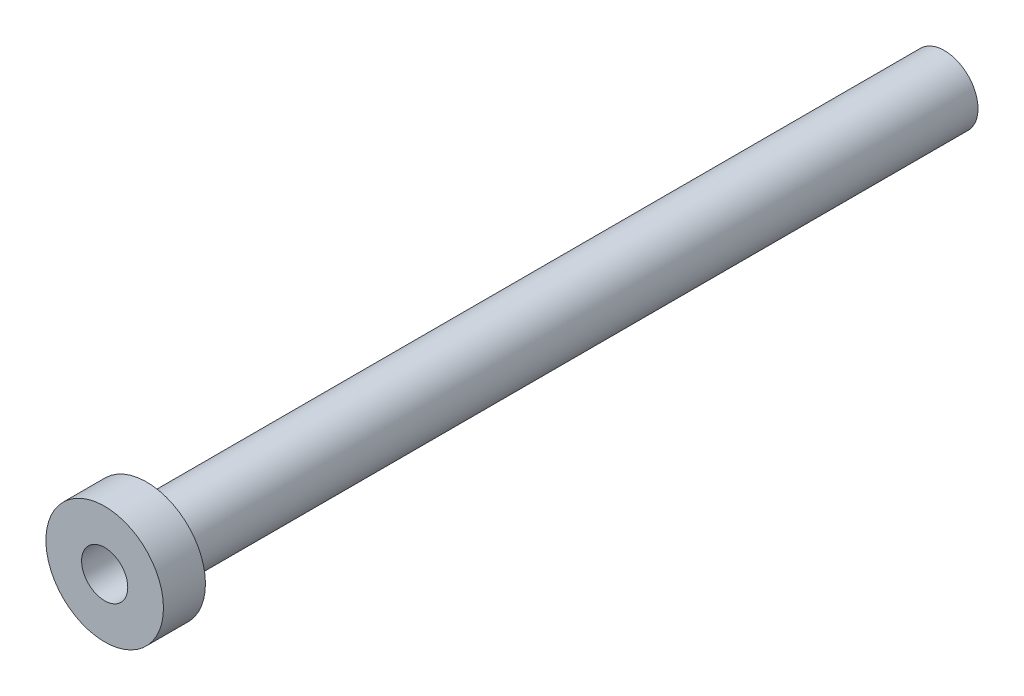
ISO-10303-21;
HEADER;
FILE_DESCRIPTION(('STEP AP214'),'2;1');
FILE_NAME('part.step','',(''),(''),'','','');
FILE_SCHEMA(('AUTOMOTIVE_DESIGN { 1 0 10303 214 1 1 1 1 }'));
ENDSEC;
DATA;
#1=APPLICATION_CONTEXT('core data for automotive mechanical design processes');
#2=APPLICATION_PROTOCOL_DEFINITION('international standard','automotive_design',2000,#1);
#3=PRODUCT_CONTEXT('',#1,'mechanical');
#4=PRODUCT('Part','Part','',(#3));
#5=PRODUCT_RELATED_PRODUCT_CATEGORY('part','',(#4));
#6=PRODUCT_DEFINITION_FORMATION('','',#4);
#7=PRODUCT_DEFINITION_CONTEXT('part definition',#1,'design');
#8=PRODUCT_DEFINITION('design','',#6,#7);
#9=PRODUCT_DEFINITION_SHAPE('','',#8);
#10=(LENGTH_UNIT() NAMED_UNIT(*) SI_UNIT(.MILLI.,.METRE.));
#11=(NAMED_UNIT(*) PLANE_ANGLE_UNIT() SI_UNIT($,.RADIAN.));
#12=(NAMED_UNIT(*) SI_UNIT($,.STERADIAN.) SOLID_ANGLE_UNIT());
#13=UNCERTAINTY_MEASURE_WITH_UNIT(LENGTH_MEASURE(1.E-05),#10,'distance_accuracy_value','');
#14=(GEOMETRIC_REPRESENTATION_CONTEXT(3) GLOBAL_UNCERTAINTY_ASSIGNED_CONTEXT((#13)) GLOBAL_UNIT_ASSIGNED_CONTEXT((#10,
#11,#12)) REPRESENTATION_CONTEXT('',''));
#15=CARTESIAN_POINT('',(0.,0.,0.));
#16=DIRECTION('',(0.,0.,1.));
#17=DIRECTION('',(1.,0.,0.));
#18=AXIS2_PLACEMENT_3D('',#15,#16,#17);
#19=CARTESIAN_POINT('',(0.,0.,0.));
#20=DIRECTION('',(0.,0.,1.));
#21=DIRECTION('',(1.,0.,0.));
#22=AXIS2_PLACEMENT_3D('',#19,#20,#21);
#23=CYLINDRICAL_SURFACE('',#22,2.50000000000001);
#24=CARTESIAN_POINT('',(0.,0.,-100.));
#25=DIRECTION('',(0.,0.,1.));
#26=DIRECTION('',(1.,0.,0.));
#27=AXIS2_PLACEMENT_3D('',#24,#25,#26);
#28=CIRCLE('',#27,2.50000000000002);
#29=CARTESIAN_POINT('',(2.50000000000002,0.,-100.));
#30=VERTEX_POINT('',#29);
#31=EDGE_CURVE('E54',#30,#30,#28,.T.);
#32=ORIENTED_EDGE('',*,*,#31,.F.);
#33=EDGE_LOOP('',(#32));
#34=FACE_BOUND('',#33,.T.);
#35=CARTESIAN_POINT('',(0.,0.,-55.));
#36=DIRECTION('',(0.,0.,1.));
#37=DIRECTION('',(1.,0.,0.));
#38=AXIS2_PLACEMENT_3D('',#35,#36,#37);
#39=CIRCLE('',#38,2.50000000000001);
#40=CARTESIAN_POINT('',(2.50000000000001,0.,-55.));
#41=VERTEX_POINT('',#40);
#42=EDGE_CURVE('E60',#41,#41,#39,.T.);
#43=ORIENTED_EDGE('',*,*,#42,.T.);
#44=EDGE_LOOP('',(#43));
#45=FACE_BOUND('',#44,.T.);
#46=ADVANCED_FACE('F34',(#34,#45),#23,.F.);
#47=CARTESIAN_POINT('',(0.,0.,0.));
#48=DIRECTION('',(0.,0.,1.));
#49=DIRECTION('',(1.,0.,0.));
#50=AXIS2_PLACEMENT_3D('',#47,#48,#49);
#51=CYLINDRICAL_SURFACE('',#50,7.);
#52=CARTESIAN_POINT('',(0.,0.,0.));
#53=DIRECTION('',(0.,0.,1.));
#54=DIRECTION('',(1.,0.,0.));
#55=AXIS2_PLACEMENT_3D('',#52,#53,#54);
#56=CIRCLE('',#55,7.);
#57=CARTESIAN_POINT('',(7.,0.,0.));
#58=VERTEX_POINT('',#57);
#59=EDGE_CURVE('E57',#58,#58,#56,.T.);
#60=ORIENTED_EDGE('',*,*,#59,.F.);
#61=EDGE_LOOP('',(#60));
#62=FACE_BOUND('',#61,.T.);
#63=CARTESIAN_POINT('',(0.,0.,-5.));
#64=DIRECTION('',(0.,0.,1.));
#65=DIRECTION('',(1.,0.,0.));
#66=AXIS2_PLACEMENT_3D('',#63,#64,#65);
#67=CIRCLE('',#66,7.);
#68=CARTESIAN_POINT('',(7.,0.,-5.));
#69=VERTEX_POINT('',#68);
#70=EDGE_CURVE('E10',#69,#69,#67,.T.);
#71=ORIENTED_EDGE('',*,*,#70,.T.);
#72=EDGE_LOOP('',(#71));
#73=FACE_BOUND('',#72,.T.);
#74=ADVANCED_FACE('F36',(#62,#73),#51,.T.);
#75=CARTESIAN_POINT('',(0.,4.5,-5.));
#76=DIRECTION('',(0.,0.,1.));
#77=DIRECTION('',(1.,0.,0.));
#78=AXIS2_PLACEMENT_3D('',#75,#76,#77);
#79=PLANE('',#78);
#80=ORIENTED_EDGE('',*,*,#70,.F.);
#81=EDGE_LOOP('',(#80));
#82=FACE_BOUND('',#81,.T.);
#83=CARTESIAN_POINT('',(0.,0.,-5.));
#84=DIRECTION('',(0.,0.,1.));
#85=DIRECTION('',(1.,0.,0.));
#86=AXIS2_PLACEMENT_3D('',#83,#84,#85);
#87=CIRCLE('',#86,4.5);
#88=CARTESIAN_POINT('',(4.5,0.,-5.));
#89=VERTEX_POINT('',#88);
#90=EDGE_CURVE('E41',#89,#89,#87,.T.);
#91=ORIENTED_EDGE('',*,*,#90,.T.);
#92=EDGE_LOOP('',(#91));
#93=FACE_BOUND('',#92,.T.);
#94=ADVANCED_FACE('F82',(#82,#93),#79,.F.);
#95=CARTESIAN_POINT('',(0.,0.,-5.5));
#96=DIRECTION('',(0.,0.,1.));
#97=DIRECTION('',(1.,0.,0.));
#98=AXIS2_PLACEMENT_3D('',#95,#96,#97);
#99=TOROIDAL_SURFACE('',#98,4.5,0.500000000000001);
#100=ORIENTED_EDGE('',*,*,#90,.F.);
#101=EDGE_LOOP('',(#100));
#102=FACE_BOUND('',#101,.T.);
#103=CARTESIAN_POINT('',(0.,0.,-5.5));
#104=DIRECTION('',(0.,0.,1.));
#105=DIRECTION('',(1.,0.,0.));
#106=AXIS2_PLACEMENT_3D('',#103,#104,#105);
#107=CIRCLE('',#106,3.99999999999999);
#108=CARTESIAN_POINT('',(3.99999999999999,0.,-5.5));
#109=VERTEX_POINT('',#108);
#110=EDGE_CURVE('E45',#109,#109,#107,.T.);
#111=ORIENTED_EDGE('',*,*,#110,.T.);
#112=EDGE_LOOP('',(#111));
#113=FACE_BOUND('',#112,.T.);
#114=ADVANCED_FACE('F87',(#102,#113),#99,.F.);
#115=CARTESIAN_POINT('',(0.,0.,0.));
#116=DIRECTION('',(0.,0.,1.));
#117=DIRECTION('',(1.,0.,0.));
#118=AXIS2_PLACEMENT_3D('',#115,#116,#117);
#119=CYLINDRICAL_SURFACE('',#118,4.);
#120=ORIENTED_EDGE('',*,*,#110,.F.);
#121=EDGE_LOOP('',(#120));
#122=FACE_BOUND('',#121,.T.);
#123=CARTESIAN_POINT('',(0.,0.,-100.));
#124=DIRECTION('',(0.,0.,1.));
#125=DIRECTION('',(1.,0.,0.));
#126=AXIS2_PLACEMENT_3D('',#123,#124,#125);
#127=CIRCLE('',#126,4.00000000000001);
#128=CARTESIAN_POINT('',(4.00000000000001,0.,-100.));
#129=VERTEX_POINT('',#128);
#130=EDGE_CURVE('E49',#129,#129,#127,.T.);
#131=ORIENTED_EDGE('',*,*,#130,.T.);
#132=EDGE_LOOP('',(#131));
#133=FACE_BOUND('',#132,.T.);
#134=ADVANCED_FACE('F99',(#122,#133),#119,.T.);
#135=CARTESIAN_POINT('',(0.,2.50000000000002,-100.));
#136=DIRECTION('',(0.,0.,1.));
#137=DIRECTION('',(1.,0.,0.));
#138=AXIS2_PLACEMENT_3D('',#135,#136,#137);
#139=PLANE('',#138);
#140=ORIENTED_EDGE('',*,*,#130,.F.);
#141=EDGE_LOOP('',(#140));
#142=FACE_BOUND('',#141,.T.);
#143=ORIENTED_EDGE('',*,*,#31,.T.);
#144=EDGE_LOOP('',(#143));
#145=FACE_BOUND('',#144,.T.);
#146=ADVANCED_FACE('F77',(#142,#145),#139,.F.);
#147=CARTESIAN_POINT('',(0.,7.,0.));
#148=DIRECTION('',(0.,0.,-1.));
#149=DIRECTION('',(-1.,0.,0.));
#150=AXIS2_PLACEMENT_3D('',#147,#148,#149);
#151=PLANE('',#150);
#152=CARTESIAN_POINT('',(0.,0.,0.));
#153=DIRECTION('',(0.,0.,1.));
#154=DIRECTION('',(1.,0.,0.));
#155=AXIS2_PLACEMENT_3D('',#152,#153,#154);
#156=CIRCLE('',#155,2.75);
#157=CARTESIAN_POINT('',(2.75,0.,0.));
#158=VERTEX_POINT('',#157);
#159=EDGE_CURVE('E66',#158,#158,#156,.T.);
#160=ORIENTED_EDGE('',*,*,#159,.F.);
#161=EDGE_LOOP('',(#160));
#162=FACE_BOUND('',#161,.T.);
#163=ORIENTED_EDGE('',*,*,#59,.T.);
#164=EDGE_LOOP('',(#163));
#165=FACE_BOUND('',#164,.T.);
#166=ADVANCED_FACE('F73',(#162,#165),#151,.F.);
#167=CARTESIAN_POINT('',(0.,0.,-55.));
#168=DIRECTION('',(0.,0.,1.));
#169=DIRECTION('',(1.,0.,0.));
#170=AXIS2_PLACEMENT_3D('',#167,#168,#169);
#171=CONICAL_SURFACE('',#170,2.50000000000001,0.349065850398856);
#172=CARTESIAN_POINT('',(0.,0.,-54.3131306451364));
#173=DIRECTION('',(0.,0.,1.));
#174=DIRECTION('',(1.,0.,0.));
#175=AXIS2_PLACEMENT_3D('',#172,#173,#174);
#176=CIRCLE('',#175,2.75);
#177=CARTESIAN_POINT('',(2.75,0.,-54.3131306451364));
#178=VERTEX_POINT('',#177);
#179=EDGE_CURVE('E63',#178,#178,#176,.T.);
#180=ORIENTED_EDGE('',*,*,#179,.T.);
#181=EDGE_LOOP('',(#180));
#182=FACE_BOUND('',#181,.T.);
#183=ORIENTED_EDGE('',*,*,#42,.F.);
#184=EDGE_LOOP('',(#183));
#185=FACE_BOUND('',#184,.T.);
#186=ADVANCED_FACE('F76',(#182,#185),#171,.F.);
#187=CARTESIAN_POINT('',(0.,0.,0.));
#188=DIRECTION('',(0.,0.,1.));
#189=DIRECTION('',(1.,0.,0.));
#190=AXIS2_PLACEMENT_3D('',#187,#188,#189);
#191=CYLINDRICAL_SURFACE('',#190,2.75);
#192=ORIENTED_EDGE('',*,*,#159,.T.);
#193=EDGE_LOOP('',(#192));
#194=FACE_BOUND('',#193,.T.);
#195=ORIENTED_EDGE('',*,*,#179,.F.);
#196=EDGE_LOOP('',(#195));
#197=FACE_BOUND('',#196,.T.);
#198=ADVANCED_FACE('F70',(#194,#197),#191,.F.);
#199=CLOSED_SHELL('',(#46,#74,#94,#114,#134,#146,#166,#186,#198));
#200=MANIFOLD_SOLID_BREP('B2',#199);
#201=ADVANCED_BREP_SHAPE_REPRESENTATION('',(#18,#200),#14);
#202=SHAPE_DEFINITION_REPRESENTATION(#9,#201);
ENDSEC;
END-ISO-10303-21;
